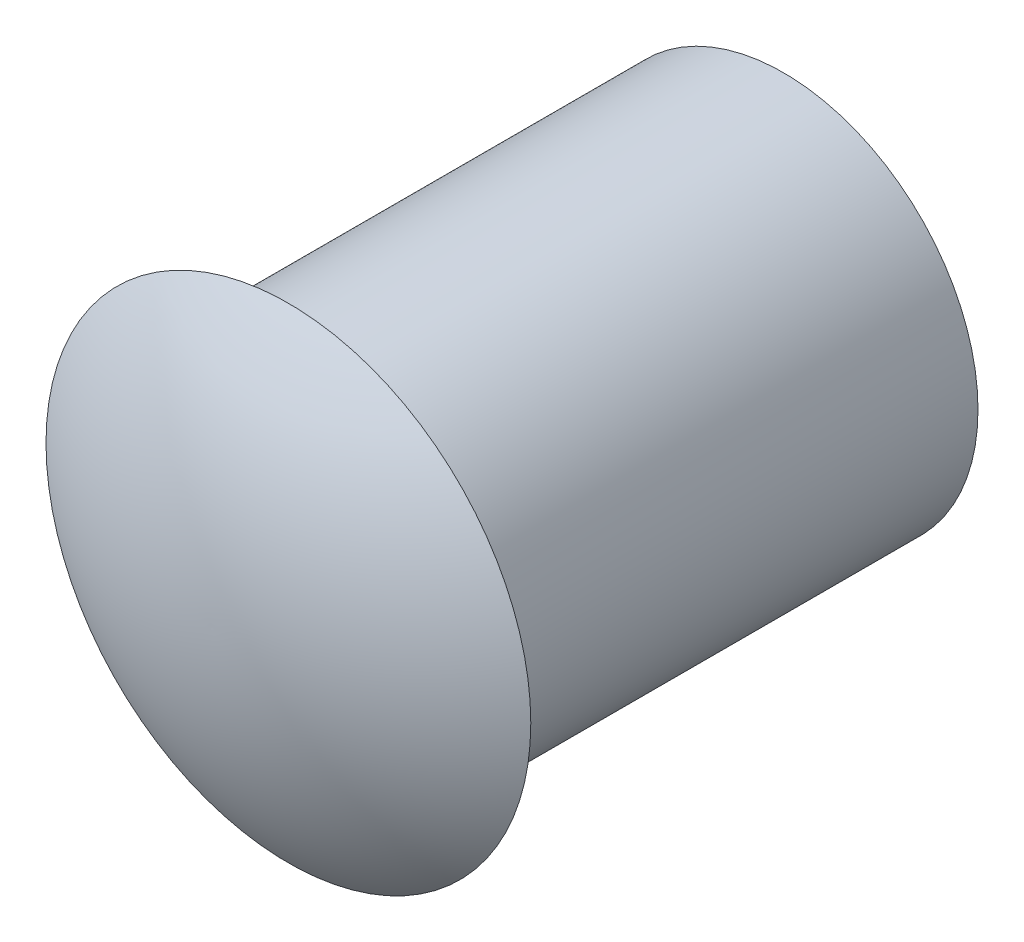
ISO-10303-21;
HEADER;
FILE_DESCRIPTION(('STEP AP214'),'2;1');
FILE_NAME('part.step','',(''),(''),'','','');
FILE_SCHEMA(('AUTOMOTIVE_DESIGN { 1 0 10303 214 1 1 1 1 }'));
ENDSEC;
DATA;
#1=APPLICATION_CONTEXT('core data for automotive mechanical design processes');
#2=APPLICATION_PROTOCOL_DEFINITION('international standard','automotive_design',2000,#1);
#3=PRODUCT_CONTEXT('',#1,'mechanical');
#4=PRODUCT('Part','Part','',(#3));
#5=PRODUCT_RELATED_PRODUCT_CATEGORY('part','',(#4));
#6=PRODUCT_DEFINITION_FORMATION('','',#4);
#7=PRODUCT_DEFINITION_CONTEXT('part definition',#1,'design');
#8=PRODUCT_DEFINITION('design','',#6,#7);
#9=PRODUCT_DEFINITION_SHAPE('','',#8);
#10=(LENGTH_UNIT() NAMED_UNIT(*) SI_UNIT(.MILLI.,.METRE.));
#11=(NAMED_UNIT(*) PLANE_ANGLE_UNIT() SI_UNIT($,.RADIAN.));
#12=(NAMED_UNIT(*) SI_UNIT($,.STERADIAN.) SOLID_ANGLE_UNIT());
#13=UNCERTAINTY_MEASURE_WITH_UNIT(LENGTH_MEASURE(1.E-05),#10,'distance_accuracy_value','');
#14=(GEOMETRIC_REPRESENTATION_CONTEXT(3) GLOBAL_UNCERTAINTY_ASSIGNED_CONTEXT((#13)) GLOBAL_UNIT_ASSIGNED_CONTEXT((#10,
#11,#12)) REPRESENTATION_CONTEXT('',''));
#15=CARTESIAN_POINT('',(0.,0.,0.));
#16=DIRECTION('',(0.,0.,1.));
#17=DIRECTION('',(1.,0.,0.));
#18=AXIS2_PLACEMENT_3D('',#15,#16,#17);
#19=CARTESIAN_POINT('',(0.,0.,-7.62));
#20=DIRECTION('',(0.,0.,1.));
#21=DIRECTION('',(1.,0.,0.));
#22=AXIS2_PLACEMENT_3D('',#19,#20,#21);
#23=CYLINDRICAL_SURFACE('',#22,2.99251043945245);
#24=CARTESIAN_POINT('',(0.,0.,-7.62));
#25=DIRECTION('',(0.,0.,1.));
#26=DIRECTION('',(1.,0.,0.));
#27=AXIS2_PLACEMENT_3D('',#24,#25,#26);
#28=CIRCLE('',#27,2.99251043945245);
#29=CARTESIAN_POINT('',(2.99251043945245,0.,-7.62));
#30=VERTEX_POINT('',#29);
#31=EDGE_CURVE('E11',#30,#30,#28,.T.);
#32=CARTESIAN_POINT('',(0.,0.,0.));
#33=DIRECTION('',(0.,0.,1.));
#34=DIRECTION('',(1.,0.,0.));
#35=AXIS2_PLACEMENT_3D('',#32,#33,#34);
#36=CIRCLE('',#35,2.99251043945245);
#37=CARTESIAN_POINT('',(2.99251043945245,0.,0.));
#38=VERTEX_POINT('',#37);
#39=EDGE_CURVE('E36',#38,#38,#36,.T.);
#40=CARTESIAN_POINT('',(2.99251043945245,0.,-7.62));
#41=CARTESIAN_POINT('',(2.99251043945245,0.,-7.540625));
#42=CARTESIAN_POINT('',(2.99251043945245,0.,-7.46125));
#43=CARTESIAN_POINT('',(2.99251043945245,0.,-7.3025));
#44=CARTESIAN_POINT('',(2.99251043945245,0.,-7.223125));
#45=CARTESIAN_POINT('',(2.99251043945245,0.,-7.064375));
#46=CARTESIAN_POINT('',(2.99251043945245,0.,-6.985));
#47=CARTESIAN_POINT('',(2.99251043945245,0.,-6.82625));
#48=CARTESIAN_POINT('',(2.99251043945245,0.,-6.746875));
#49=CARTESIAN_POINT('',(2.99251043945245,0.,-6.588125));
#50=CARTESIAN_POINT('',(2.99251043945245,0.,-6.50875));
#51=CARTESIAN_POINT('',(2.99251043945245,0.,-6.35));
#52=CARTESIAN_POINT('',(2.99251043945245,0.,-6.270625));
#53=CARTESIAN_POINT('',(2.99251043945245,0.,-6.111875));
#54=CARTESIAN_POINT('',(2.99251043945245,0.,-6.0325));
#55=CARTESIAN_POINT('',(2.99251043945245,0.,-5.87375));
#56=CARTESIAN_POINT('',(2.99251043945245,0.,-5.794375));
#57=CARTESIAN_POINT('',(2.99251043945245,0.,-5.635625));
#58=CARTESIAN_POINT('',(2.99251043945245,0.,-5.55625));
#59=CARTESIAN_POINT('',(2.99251043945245,0.,-5.3975));
#60=CARTESIAN_POINT('',(2.99251043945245,0.,-5.318125));
#61=CARTESIAN_POINT('',(2.99251043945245,0.,-5.159375));
#62=CARTESIAN_POINT('',(2.99251043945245,0.,-5.08));
#63=CARTESIAN_POINT('',(2.99251043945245,0.,-4.92125));
#64=CARTESIAN_POINT('',(2.99251043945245,0.,-4.841875));
#65=CARTESIAN_POINT('',(2.99251043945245,0.,-4.683125));
#66=CARTESIAN_POINT('',(2.99251043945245,0.,-4.60375));
#67=CARTESIAN_POINT('',(2.99251043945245,0.,-4.445));
#68=CARTESIAN_POINT('',(2.99251043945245,0.,-4.365625));
#69=CARTESIAN_POINT('',(2.99251043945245,0.,-4.206875));
#70=CARTESIAN_POINT('',(2.99251043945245,0.,-4.1275));
#71=CARTESIAN_POINT('',(2.99251043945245,0.,-3.96875));
#72=CARTESIAN_POINT('',(2.99251043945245,0.,-3.889375));
#73=CARTESIAN_POINT('',(2.99251043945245,0.,-3.730625));
#74=CARTESIAN_POINT('',(2.99251043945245,0.,-3.65125));
#75=CARTESIAN_POINT('',(2.99251043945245,0.,-3.4925));
#76=CARTESIAN_POINT('',(2.99251043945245,0.,-3.413125));
#77=CARTESIAN_POINT('',(2.99251043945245,0.,-3.254375));
#78=CARTESIAN_POINT('',(2.99251043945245,0.,-3.175));
#79=CARTESIAN_POINT('',(2.99251043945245,0.,-3.01625));
#80=CARTESIAN_POINT('',(2.99251043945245,0.,-2.936875));
#81=CARTESIAN_POINT('',(2.99251043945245,0.,-2.778125));
#82=CARTESIAN_POINT('',(2.99251043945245,0.,-2.69875));
#83=CARTESIAN_POINT('',(2.99251043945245,0.,-2.54));
#84=CARTESIAN_POINT('',(2.99251043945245,0.,-2.460625));
#85=CARTESIAN_POINT('',(2.99251043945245,0.,-2.301875));
#86=CARTESIAN_POINT('',(2.99251043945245,0.,-2.2225));
#87=CARTESIAN_POINT('',(2.99251043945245,0.,-2.06375));
#88=CARTESIAN_POINT('',(2.99251043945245,0.,-1.984375));
#89=CARTESIAN_POINT('',(2.99251043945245,0.,-1.825625));
#90=CARTESIAN_POINT('',(2.99251043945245,0.,-1.74625));
#91=CARTESIAN_POINT('',(2.99251043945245,0.,-1.5875));
#92=CARTESIAN_POINT('',(2.99251043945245,0.,-1.508125));
#93=CARTESIAN_POINT('',(2.99251043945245,0.,-1.349375));
#94=CARTESIAN_POINT('',(2.99251043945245,0.,-1.27));
#95=CARTESIAN_POINT('',(2.99251043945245,0.,-1.11125));
#96=CARTESIAN_POINT('',(2.99251043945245,0.,-1.031875));
#97=CARTESIAN_POINT('',(2.99251043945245,0.,-0.873125));
#98=CARTESIAN_POINT('',(2.99251043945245,0.,-0.79375));
#99=CARTESIAN_POINT('',(2.99251043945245,0.,-0.635));
#100=CARTESIAN_POINT('',(2.99251043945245,0.,-0.555625));
#101=CARTESIAN_POINT('',(2.99251043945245,0.,-0.396875));
#102=CARTESIAN_POINT('',(2.99251043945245,0.,-0.3175));
#103=CARTESIAN_POINT('',(2.99251043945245,0.,-0.15875));
#104=CARTESIAN_POINT('',(2.99251043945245,0.,-0.0793749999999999));
#105=CARTESIAN_POINT('',(2.99251043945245,0.,0.));
#106=B_SPLINE_CURVE_WITH_KNOTS('',3,(#40,#41,#42,#43,#44,#45,#46,#47,#48,#49,#50,#51,#52,#53,
#54,#55,#56,#57,#58,#59,#60,#61,#62,#63,#64,#65,#66,#67,#68,#69,#70,#71,#72,#73,#74,#75,#76,#77,
#78,#79,#80,#81,#82,#83,#84,#85,#86,#87,#88,#89,#90,#91,#92,#93,#94,#95,#96,#97,#98,#99,#100,
#101,#102,#103,#104,#105),.UNSPECIFIED.,.F.,.F.,(4,2,2,2,2,2,2,2,2,2,2,2,2,2,2,2,2,2,2,2,2,2,2,
2,2,2,2,2,2,2,2,2,4),(0.,0.238125,0.47625,0.714375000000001,0.9525,1.190625,1.42875,1.666875,
1.905,2.143125,2.38125,2.619375,2.8575,3.095625,3.33375,3.571875,3.81,4.048125,4.28625,4.524375,
4.7625,5.000625,5.23875,5.476875,5.715,5.953125,6.19125,6.429375,6.6675,6.905625,7.14375,
7.381875,7.62),.UNSPECIFIED.);
#107=EDGE_CURVE('BSEAM33',#30,#38,#106,.T.);
#108=ORIENTED_EDGE('',*,*,#31,.T.);
#109=ORIENTED_EDGE('',*,*,#39,.F.);
#110=ORIENTED_EDGE('',*,*,#107,.T.);
#111=ORIENTED_EDGE('',*,*,#107,.F.);
#112=EDGE_LOOP('',(#108,#110,#109,#111));
#113=FACE_BOUND('',#112,.T.);
#114=ADVANCED_FACE('F33',(#113),#23,.T.);
#115=CARTESIAN_POINT('',(0.,0.,-7.62));
#116=DIRECTION('',(0.,0.,1.));
#117=DIRECTION('',(1.,0.,0.));
#118=AXIS2_PLACEMENT_3D('',#115,#116,#117);
#119=PLANE('',#118);
#120=ORIENTED_EDGE('',*,*,#31,.F.);
#121=EDGE_LOOP('',(#120));
#122=FACE_BOUND('',#121,.T.);
#123=ADVANCED_FACE('F46',(#122),#119,.F.);
#124=CARTESIAN_POINT('',(-0.045212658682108,0.,-5.15900585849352));
#125=DIRECTION('',(0.,-1.,0.));
#126=DIRECTION('',(-1.,0.,0.));
#127=AXIS2_PLACEMENT_3D('',#124,#125,#126);
#128=CIRCLE('',#127,6.33998070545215);
#129=TRIMMED_CURVE('',#128,(PARAMETER_VALUE(-1.57792774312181)),
(PARAMETER_VALUE(1.57792774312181)),.T.,.PARAMETER.);
#130=CARTESIAN_POINT('',(0.,0.,-5.15900585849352));
#131=DIRECTION('',(0.,0.,-1.));
#132=AXIS1_PLACEMENT('',#130,#131);
#133=SURFACE_OF_REVOLUTION('',#129,#132);
#134=CARTESIAN_POINT('',(0.,0.,1.18081363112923));
#135=VERTEX_POINT('',#134);
#136=VERTEX_LOOP('',#135);
#137=FACE_BOUND('',#136,.T.);
#138=CARTESIAN_POINT('',(0.,0.,0.));
#139=DIRECTION('',(0.,0.,-1.));
#140=DIRECTION('',(-1.,0.,0.));
#141=AXIS2_PLACEMENT_3D('',#138,#139,#140);
#142=CIRCLE('',#141,3.73031969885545);
#143=CARTESIAN_POINT('',(-3.73031969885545,0.,0.));
#144=VERTEX_POINT('',#143);
#145=EDGE_CURVE('E50',#144,#144,#142,.T.);
#146=ORIENTED_EDGE('',*,*,#145,.F.);
#147=EDGE_LOOP('',(#146));
#148=FACE_BOUND('',#147,.T.);
#149=ADVANCED_FACE('F42',(#137,#148),#133,.T.);
#150=CARTESIAN_POINT('',(-3.73031969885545,0.,0.));
#151=DIRECTION('',(0.,0.,-1.));
#152=DIRECTION('',(-1.,0.,0.));
#153=AXIS2_PLACEMENT_3D('',#150,#151,#152);
#154=PLANE('',#153);
#155=ORIENTED_EDGE('',*,*,#39,.T.);
#156=EDGE_LOOP('',(#155));
#157=FACE_BOUND('',#156,.T.);
#158=ORIENTED_EDGE('',*,*,#145,.T.);
#159=EDGE_LOOP('',(#158));
#160=FACE_BOUND('',#159,.T.);
#161=ADVANCED_FACE('F45',(#157,#160),#154,.T.);
#162=CLOSED_SHELL('',(#114,#123,#149,#161));
#163=MANIFOLD_SOLID_BREP('B2',#162);
#164=ADVANCED_BREP_SHAPE_REPRESENTATION('',(#18,#163),#14);
#165=SHAPE_DEFINITION_REPRESENTATION(#9,#164);
ENDSEC;
END-ISO-10303-21;
